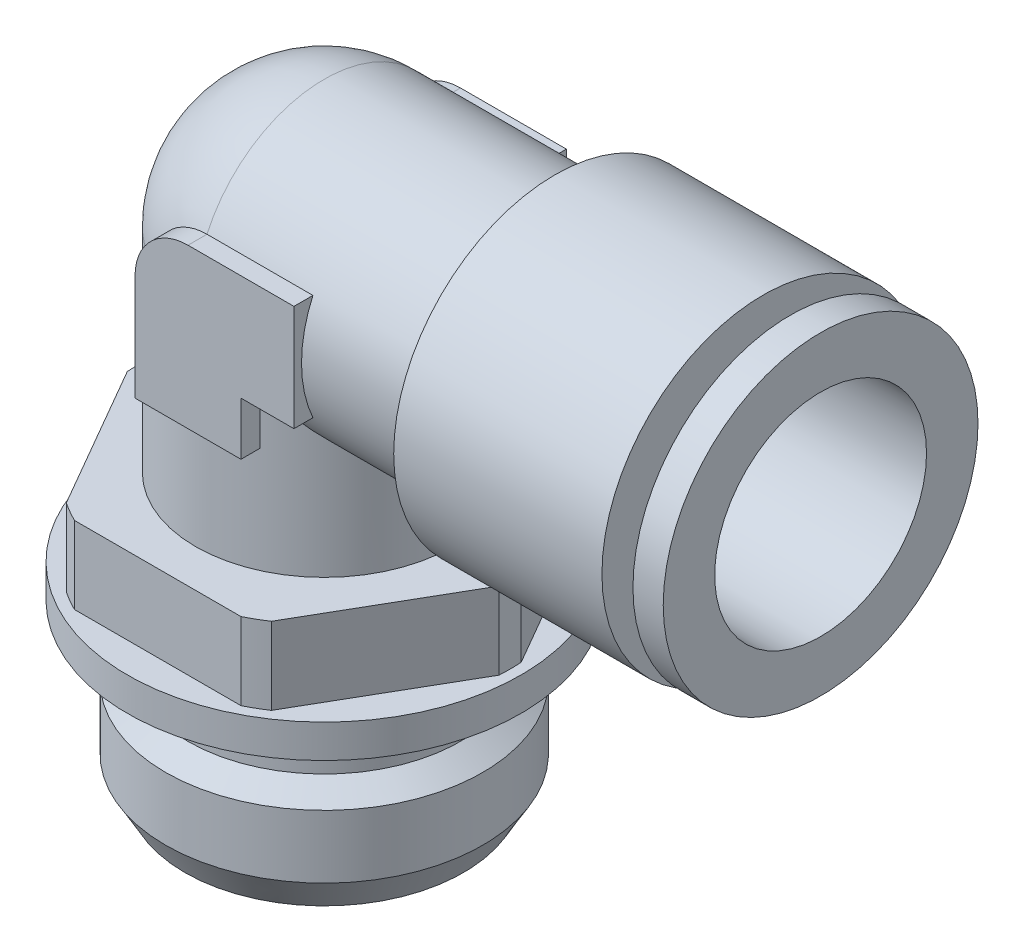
ISO-10303-21;
HEADER;
FILE_DESCRIPTION(('STEP AP214'),'2;1');
FILE_NAME('part.step','',(''),(''),'','','');
FILE_SCHEMA(('AUTOMOTIVE_DESIGN { 1 0 10303 214 1 1 1 1 }'));
ENDSEC;
DATA;
#1=APPLICATION_CONTEXT('core data for automotive mechanical design processes');
#2=APPLICATION_PROTOCOL_DEFINITION('international standard','automotive_design',2000,#1);
#3=PRODUCT_CONTEXT('',#1,'mechanical');
#4=PRODUCT('Part','Part','',(#3));
#5=PRODUCT_RELATED_PRODUCT_CATEGORY('part','',(#4));
#6=PRODUCT_DEFINITION_FORMATION('','',#4);
#7=PRODUCT_DEFINITION_CONTEXT('part definition',#1,'design');
#8=PRODUCT_DEFINITION('design','',#6,#7);
#9=PRODUCT_DEFINITION_SHAPE('','',#8);
#10=(LENGTH_UNIT() NAMED_UNIT(*) SI_UNIT(.MILLI.,.METRE.));
#11=(NAMED_UNIT(*) PLANE_ANGLE_UNIT() SI_UNIT($,.RADIAN.));
#12=(NAMED_UNIT(*) SI_UNIT($,.STERADIAN.) SOLID_ANGLE_UNIT());
#13=UNCERTAINTY_MEASURE_WITH_UNIT(LENGTH_MEASURE(1.E-05),#10,'distance_accuracy_value','');
#14=(GEOMETRIC_REPRESENTATION_CONTEXT(3) GLOBAL_UNCERTAINTY_ASSIGNED_CONTEXT((#13)) GLOBAL_UNIT_ASSIGNED_CONTEXT((#10,
#11,#12)) REPRESENTATION_CONTEXT('',''));
#15=CARTESIAN_POINT('',(0.,0.,0.));
#16=DIRECTION('',(0.,0.,1.));
#17=DIRECTION('',(1.,0.,0.));
#18=AXIS2_PLACEMENT_3D('',#15,#16,#17);
#19=CARTESIAN_POINT('',(0.,-30.1,0.));
#20=DIRECTION('',(0.,1.,0.));
#21=DIRECTION('',(0.,0.,1.));
#22=AXIS2_PLACEMENT_3D('',#19,#20,#21);
#23=CONICAL_SURFACE('',#22,10.4775,0.523598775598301);
#24=CARTESIAN_POINT('',(0.,-32.3,0.));
#25=DIRECTION('',(0.,1.,0.));
#26=DIRECTION('',(0.,0.,1.));
#27=AXIS2_PLACEMENT_3D('',#24,#25,#26);
#28=CIRCLE('',#27,9.20732940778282);
#29=CARTESIAN_POINT('',(0.,-32.3,9.20732940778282));
#30=VERTEX_POINT('',#29);
#31=EDGE_CURVE('E20',#30,#30,#28,.T.);
#32=ORIENTED_EDGE('',*,*,#31,.T.);
#33=EDGE_LOOP('',(#32));
#34=FACE_BOUND('',#33,.T.);
#35=CARTESIAN_POINT('',(0.,-30.1,0.));
#36=DIRECTION('',(0.,-1.,0.));
#37=DIRECTION('',(0.,0.,-1.));
#38=AXIS2_PLACEMENT_3D('',#35,#36,#37);
#39=CIRCLE('',#38,10.4775);
#40=CARTESIAN_POINT('',(0.,-30.1,-10.4775));
#41=VERTEX_POINT('',#40);
#42=EDGE_CURVE('E219',#41,#41,#39,.F.);
#43=ORIENTED_EDGE('',*,*,#42,.F.);
#44=EDGE_LOOP('',(#43));
#45=FACE_BOUND('',#44,.T.);
#46=ADVANCED_FACE('F16',(#34,#45),#23,.T.);
#47=CARTESIAN_POINT('',(0.,-19.6147348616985,0.));
#48=DIRECTION('',(0.,-1.,0.));
#49=DIRECTION('',(0.,0.,-1.));
#50=AXIS2_PLACEMENT_3D('',#47,#48,#49);
#51=CYLINDRICAL_SURFACE('',#50,10.4775);
#52=ORIENTED_EDGE('',*,*,#42,.T.);
#53=EDGE_LOOP('',(#52));
#54=FACE_BOUND('',#53,.T.);
#55=CARTESIAN_POINT('',(0.,-25.9345566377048,0.));
#56=DIRECTION('',(0.,-1.,0.));
#57=DIRECTION('',(0.,0.,-1.));
#58=AXIS2_PLACEMENT_3D('',#55,#56,#57);
#59=CIRCLE('',#58,10.4775);
#60=CARTESIAN_POINT('',(0.,-25.9345566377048,-10.4775));
#61=VERTEX_POINT('',#60);
#62=EDGE_CURVE('E215',#61,#61,#59,.F.);
#63=ORIENTED_EDGE('',*,*,#62,.F.);
#64=EDGE_LOOP('',(#63));
#65=FACE_BOUND('',#64,.T.);
#66=ADVANCED_FACE('F1185',(#54,#65),#51,.T.);
#67=CARTESIAN_POINT('',(-9.20732940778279,-32.3,0.));
#68=DIRECTION('',(0.,1.,0.));
#69=DIRECTION('',(0.,0.,1.));
#70=AXIS2_PLACEMENT_3D('',#67,#68,#69);
#71=PLANE('',#70);
#72=ORIENTED_EDGE('',*,*,#31,.F.);
#73=EDGE_LOOP('',(#72));
#74=FACE_BOUND('',#73,.T.);
#75=CARTESIAN_POINT('',(0.,-32.3,0.));
#76=DIRECTION('',(0.,-1.,0.));
#77=DIRECTION('',(0.,0.,-1.));
#78=AXIS2_PLACEMENT_3D('',#75,#76,#77);
#79=CIRCLE('',#78,5.85);
#80=CARTESIAN_POINT('',(0.,-32.3,-5.85));
#81=VERTEX_POINT('',#80);
#82=EDGE_CURVE('E214',#81,#81,#79,.F.);
#83=ORIENTED_EDGE('',*,*,#82,.T.);
#84=EDGE_LOOP('',(#83));
#85=FACE_BOUND('',#84,.T.);
#86=ADVANCED_FACE('F352',(#74,#85),#71,.F.);
#87=CARTESIAN_POINT('',(0.,-25.9345566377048,0.));
#88=DIRECTION('',(0.,-1.,0.));
#89=DIRECTION('',(0.,0.,-1.));
#90=AXIS2_PLACEMENT_3D('',#87,#88,#89);
#91=CONICAL_SURFACE('',#90,10.4775,0.959931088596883);
#92=ORIENTED_EDGE('',*,*,#62,.T.);
#93=EDGE_LOOP('',(#92));
#94=FACE_BOUND('',#93,.T.);
#95=CARTESIAN_POINT('',(0.,-24.9,0.));
#96=DIRECTION('',(0.,-1.,0.));
#97=DIRECTION('',(0.,0.,-1.));
#98=AXIS2_PLACEMENT_3D('',#95,#96,#97);
#99=CIRCLE('',#98,9.);
#100=CARTESIAN_POINT('',(0.,-24.9,-9.00000000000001));
#101=VERTEX_POINT('',#100);
#102=EDGE_CURVE('E210',#101,#101,#99,.F.);
#103=ORIENTED_EDGE('',*,*,#102,.F.);
#104=EDGE_LOOP('',(#103));
#105=FACE_BOUND('',#104,.T.);
#106=ADVANCED_FACE('F357',(#94,#105),#91,.T.);
#107=CARTESIAN_POINT('',(0.,2.54629867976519,0.));
#108=DIRECTION('',(0.,-1.,0.));
#109=DIRECTION('',(0.,0.,-1.));
#110=AXIS2_PLACEMENT_3D('',#107,#108,#109);
#111=CYLINDRICAL_SURFACE('',#110,5.85);
#112=CARTESIAN_POINT('',(0.,-14.,0.));
#113=DIRECTION('',(0.,-1.,0.));
#114=DIRECTION('',(0.,0.,-1.));
#115=AXIS2_PLACEMENT_3D('',#112,#113,#114);
#116=CIRCLE('',#115,5.85);
#117=CARTESIAN_POINT('',(0.,-14.,-5.85));
#118=VERTEX_POINT('',#117);
#119=EDGE_CURVE('E209',#118,#118,#116,.T.);
#120=ORIENTED_EDGE('',*,*,#119,.F.);
#121=EDGE_LOOP('',(#120));
#122=FACE_BOUND('',#121,.T.);
#123=ORIENTED_EDGE('',*,*,#82,.F.);
#124=EDGE_LOOP('',(#123));
#125=FACE_BOUND('',#124,.T.);
#126=ADVANCED_FACE('F354',(#122,#125),#111,.F.);
#127=CARTESIAN_POINT('',(0.,-19.6147348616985,0.));
#128=DIRECTION('',(0.,-1.,0.));
#129=DIRECTION('',(0.,0.,-1.));
#130=AXIS2_PLACEMENT_3D('',#127,#128,#129);
#131=CYLINDRICAL_SURFACE('',#130,9.);
#132=ORIENTED_EDGE('',*,*,#102,.T.);
#133=EDGE_LOOP('',(#132));
#134=FACE_BOUND('',#133,.T.);
#135=CARTESIAN_POINT('',(0.,-21.3,0.));
#136=DIRECTION('',(0.,-1.,0.));
#137=DIRECTION('',(0.,0.,-1.));
#138=AXIS2_PLACEMENT_3D('',#135,#136,#137);
#139=CIRCLE('',#138,9.);
#140=CARTESIAN_POINT('',(0.,-21.3,-9.00000000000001));
#141=VERTEX_POINT('',#140);
#142=EDGE_CURVE('E205',#141,#141,#139,.F.);
#143=ORIENTED_EDGE('',*,*,#142,.F.);
#144=EDGE_LOOP('',(#143));
#145=FACE_BOUND('',#144,.T.);
#146=ADVANCED_FACE('F356',(#134,#145),#131,.T.);
#147=CARTESIAN_POINT('',(-8.49999999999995,-14.,0.));
#148=DIRECTION('',(0.,-1.,0.));
#149=DIRECTION('',(0.,0.,-1.));
#150=AXIS2_PLACEMENT_3D('',#147,#148,#149);
#151=PLANE('',#150);
#152=ORIENTED_EDGE('',*,*,#119,.T.);
#153=EDGE_LOOP('',(#152));
#154=FACE_BOUND('',#153,.T.);
#155=CARTESIAN_POINT('',(0.,-14.,0.));
#156=DIRECTION('',(0.,1.,0.));
#157=DIRECTION('',(0.,0.,1.));
#158=AXIS2_PLACEMENT_3D('',#155,#156,#157);
#159=CIRCLE('',#158,3.);
#160=CARTESIAN_POINT('',(0.,-14.,3.));
#161=VERTEX_POINT('',#160);
#162=EDGE_CURVE('E183',#161,#161,#159,.T.);
#163=ORIENTED_EDGE('',*,*,#162,.T.);
#164=EDGE_LOOP('',(#163));
#165=FACE_BOUND('',#164,.T.);
#166=ADVANCED_FACE('F364',(#154,#165),#151,.T.);
#167=CARTESIAN_POINT('',(0.,-21.3,0.));
#168=DIRECTION('',(0.,-1.,0.));
#169=DIRECTION('',(0.,0.,-1.));
#170=AXIS2_PLACEMENT_3D('',#167,#168,#169);
#171=TOROIDAL_SURFACE('',#170,10.31,1.31);
#172=ORIENTED_EDGE('',*,*,#142,.T.);
#173=EDGE_LOOP('',(#172));
#174=FACE_BOUND('',#173,.T.);
#175=CARTESIAN_POINT('',(0.,-21.3,0.));
#176=DIRECTION('',(0.,-1.,0.));
#177=DIRECTION('',(0.,0.,-1.));
#178=AXIS2_PLACEMENT_3D('',#175,#176,#177);
#179=CIRCLE('',#178,11.62);
#180=CARTESIAN_POINT('',(0.,-21.3,-11.62));
#181=VERTEX_POINT('',#180);
#182=EDGE_CURVE('E182',#181,#181,#179,.T.);
#183=ORIENTED_EDGE('',*,*,#182,.T.);
#184=EDGE_LOOP('',(#183));
#185=FACE_BOUND('',#184,.T.);
#186=ADVANCED_FACE('F1148',(#174,#185),#171,.T.);
#187=CARTESIAN_POINT('',(0.,2.67934415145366,0.));
#188=DIRECTION('',(0.,1.,0.));
#189=DIRECTION('',(0.,0.,1.));
#190=AXIS2_PLACEMENT_3D('',#187,#188,#189);
#191=CYLINDRICAL_SURFACE('',#190,3.);
#192=ORIENTED_EDGE('',*,*,#162,.F.);
#193=EDGE_LOOP('',(#192));
#194=FACE_BOUND('',#193,.T.);
#195=CARTESIAN_POINT('',(0.,0.,0.));
#196=DIRECTION('',(0.,1.,0.));
#197=DIRECTION('',(-1.,0.,0.));
#198=AXIS2_PLACEMENT_3D('',#195,#196,#197);
#199=CIRCLE('',#198,3.);
#200=CARTESIAN_POINT('',(0.,0.,-3.00000000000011));
#201=VERTEX_POINT('',#200);
#202=CARTESIAN_POINT('',(0.,0.,3.00000000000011));
#203=VERTEX_POINT('',#202);
#204=EDGE_CURVE('E171',#201,#203,#199,.T.);
#205=ORIENTED_EDGE('',*,*,#204,.T.);
#206=CARTESIAN_POINT('',(0.,0.,0.));
#207=DIRECTION('',(0.707106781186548,0.707106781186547,0.));
#208=DIRECTION('',(-0.707106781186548,0.707106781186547,0.));
#209=AXIS2_PLACEMENT_3D('',#206,#207,#208);
#210=ELLIPSE('',#209,4.24264068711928,3.);
#211=EDGE_CURVE('E185',#203,#201,#210,.T.);
#212=ORIENTED_EDGE('',*,*,#211,.T.);
#213=EDGE_LOOP('',(#205,#212));
#214=FACE_BOUND('',#213,.T.);
#215=ADVANCED_FACE('F186',(#194,#214),#191,.F.);
#216=CARTESIAN_POINT('',(0.,0.,0.));
#217=DIRECTION('',(0.,1.,0.));
#218=DIRECTION('',(-1.,0.,0.));
#219=AXIS2_PLACEMENT_3D('',#216,#217,#218);
#220=SPHERICAL_SURFACE('',#219,3.);
#221=ORIENTED_EDGE('',*,*,#204,.F.);
#222=CARTESIAN_POINT('',(0.,0.,0.));
#223=DIRECTION('',(1.,0.,0.));
#224=DIRECTION('',(0.,0.,-1.));
#225=AXIS2_PLACEMENT_3D('',#222,#223,#224);
#226=CIRCLE('',#225,3.);
#227=CARTESIAN_POINT('',(0.,3.,0.));
#228=VERTEX_POINT('',#227);
#229=EDGE_CURVE('E176',#201,#228,#226,.T.);
#230=ORIENTED_EDGE('',*,*,#229,.T.);
#231=CARTESIAN_POINT('',(0.,0.,0.));
#232=DIRECTION('',(1.,0.,0.));
#233=DIRECTION('',(0.,0.,-1.));
#234=AXIS2_PLACEMENT_3D('',#231,#232,#233);
#235=CIRCLE('',#234,3.);
#236=EDGE_CURVE('E179',#228,#203,#235,.T.);
#237=ORIENTED_EDGE('',*,*,#236,.T.);
#238=EDGE_LOOP('',(#221,#230,#237));
#239=FACE_BOUND('',#238,.T.);
#240=ADVANCED_FACE('F178',(#239),#220,.F.);
#241=CARTESIAN_POINT('',(-12.9999999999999,-21.3,0.));
#242=DIRECTION('',(0.,1.,0.));
#243=DIRECTION('',(0.,0.,1.));
#244=AXIS2_PLACEMENT_3D('',#241,#242,#243);
#245=PLANE('',#244);
#246=CARTESIAN_POINT('',(0.,-21.3,0.));
#247=DIRECTION('',(0.,-1.,0.));
#248=DIRECTION('',(0.,0.,-1.));
#249=AXIS2_PLACEMENT_3D('',#246,#247,#248);
#250=CIRCLE('',#249,13.);
#251=CARTESIAN_POINT('',(0.,-21.3,-13.));
#252=VERTEX_POINT('',#251);
#253=EDGE_CURVE('E198',#252,#252,#250,.F.);
#254=ORIENTED_EDGE('',*,*,#253,.F.);
#255=EDGE_LOOP('',(#254));
#256=FACE_BOUND('',#255,.T.);
#257=ORIENTED_EDGE('',*,*,#182,.F.);
#258=EDGE_LOOP('',(#257));
#259=FACE_BOUND('',#258,.T.);
#260=ADVANCED_FACE('F825',(#256,#259),#245,.F.);
#261=CARTESIAN_POINT('',(9.10972222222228,0.,0.));
#262=DIRECTION('',(1.,0.,0.));
#263=DIRECTION('',(0.,0.,-1.));
#264=AXIS2_PLACEMENT_3D('',#261,#262,#263);
#265=CYLINDRICAL_SURFACE('',#264,3.);
#266=ORIENTED_EDGE('',*,*,#229,.F.);
#267=ORIENTED_EDGE('',*,*,#211,.F.);
#268=ORIENTED_EDGE('',*,*,#236,.F.);
#269=EDGE_LOOP('',(#266,#267,#268));
#270=FACE_BOUND('',#269,.T.);
#271=CARTESIAN_POINT('',(10.824573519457,0.,0.));
#272=DIRECTION('',(1.,0.,0.));
#273=DIRECTION('',(0.,0.,-1.));
#274=AXIS2_PLACEMENT_3D('',#271,#272,#273);
#275=CIRCLE('',#274,3.);
#276=CARTESIAN_POINT('',(10.824573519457,0.,-3.));
#277=VERTEX_POINT('',#276);
#278=EDGE_CURVE('E334',#277,#277,#275,.T.);
#279=ORIENTED_EDGE('',*,*,#278,.T.);
#280=EDGE_LOOP('',(#279));
#281=FACE_BOUND('',#280,.T.);
#282=ADVANCED_FACE('F190',(#270,#281),#265,.F.);
#283=CARTESIAN_POINT('',(0.,-19.6147348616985,0.));
#284=DIRECTION('',(0.,-1.,0.));
#285=DIRECTION('',(0.,0.,-1.));
#286=AXIS2_PLACEMENT_3D('',#283,#284,#285);
#287=CYLINDRICAL_SURFACE('',#286,13.);
#288=ORIENTED_EDGE('',*,*,#253,.T.);
#289=EDGE_LOOP('',(#288));
#290=FACE_BOUND('',#289,.T.);
#291=CARTESIAN_POINT('',(0.,-19.1,0.));
#292=DIRECTION('',(0.,-1.,0.));
#293=DIRECTION('',(0.,0.,-1.));
#294=AXIS2_PLACEMENT_3D('',#291,#292,#293);
#295=CIRCLE('',#294,13.);
#296=CARTESIAN_POINT('',(0.,-19.1,-13.));
#297=VERTEX_POINT('',#296);
#298=EDGE_CURVE('E301',#297,#297,#295,.T.);
#299=ORIENTED_EDGE('',*,*,#298,.T.);
#300=EDGE_LOOP('',(#299));
#301=FACE_BOUND('',#300,.T.);
#302=ADVANCED_FACE('F656',(#290,#301),#287,.T.);
#303=CARTESIAN_POINT('',(13.1339745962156,0.,0.));
#304=DIRECTION('',(1.,0.,0.));
#305=DIRECTION('',(0.,1.,0.));
#306=AXIS2_PLACEMENT_3D('',#303,#304,#305);
#307=CONICAL_SURFACE('',#306,7.,1.0471975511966);
#308=ORIENTED_EDGE('',*,*,#278,.F.);
#309=EDGE_LOOP('',(#308));
#310=FACE_BOUND('',#309,.T.);
#311=CARTESIAN_POINT('',(13.1339745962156,0.,0.));
#312=DIRECTION('',(1.,0.,0.));
#313=DIRECTION('',(0.,0.,-1.));
#314=AXIS2_PLACEMENT_3D('',#311,#312,#313);
#315=CIRCLE('',#314,7.);
#316=CARTESIAN_POINT('',(13.1339745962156,0.,-7.00000000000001));
#317=VERTEX_POINT('',#316);
#318=EDGE_CURVE('E296',#317,#317,#315,.T.);
#319=ORIENTED_EDGE('',*,*,#318,.T.);
#320=EDGE_LOOP('',(#319));
#321=FACE_BOUND('',#320,.T.);
#322=ADVANCED_FACE('F652',(#310,#321),#307,.F.);
#323=CARTESIAN_POINT('',(0.,-19.6147348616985,0.));
#324=DIRECTION('',(0.,-1.,0.));
#325=DIRECTION('',(0.,0.,-1.));
#326=AXIS2_PLACEMENT_3D('',#323,#324,#325);
#327=CYLINDRICAL_SURFACE('',#326,12.3);
#328=CARTESIAN_POINT('',(0.,-19.1,0.));
#329=DIRECTION('',(0.,-1.,0.));
#330=DIRECTION('',(0.,0.,-1.));
#331=AXIS2_PLACEMENT_3D('',#328,#329,#330);
#332=CIRCLE('',#331,12.3);
#333=CARTESIAN_POINT('',(6.77446186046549,-19.1,-10.2662878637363));
#334=VERTEX_POINT('',#333);
#335=CARTESIAN_POINT('',(5.50363516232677,-19.1,-11.0000000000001));
#336=VERTEX_POINT('',#335);
#337=EDGE_CURVE('E308',#334,#336,#332,.F.);
#338=ORIENTED_EDGE('',*,*,#337,.T.);
#339=DIRECTION('',(0.,1.,0.));
#340=VECTOR('',#339,1.);
#341=CARTESIAN_POINT('',(5.50363516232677,39.1920122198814,-11.0000000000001));
#342=LINE('',#341,#340);
#343=CARTESIAN_POINT('',(5.50363516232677,-14.,-11.0000000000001));
#344=VERTEX_POINT('',#343);
#345=EDGE_CURVE('E614',#336,#344,#342,.T.);
#346=ORIENTED_EDGE('',*,*,#345,.T.);
#347=CARTESIAN_POINT('',(0.,-14.,0.));
#348=DIRECTION('',(0.,-1.,0.));
#349=DIRECTION('',(0.,0.,-1.));
#350=AXIS2_PLACEMENT_3D('',#347,#348,#349);
#351=CIRCLE('',#350,12.3);
#352=CARTESIAN_POINT('',(6.77446186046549,-14.,-10.2662878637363));
#353=VERTEX_POINT('',#352);
#354=EDGE_CURVE('E331',#344,#353,#351,.T.);
#355=ORIENTED_EDGE('',*,*,#354,.T.);
#356=DIRECTION('',(0.,1.,0.));
#357=VECTOR('',#356,1.);
#358=CARTESIAN_POINT('',(6.77446186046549,39.1920122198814,-10.2662878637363));
#359=LINE('',#358,#357);
#360=EDGE_CURVE('E610',#353,#334,#359,.F.);
#361=ORIENTED_EDGE('',*,*,#360,.T.);
#362=EDGE_LOOP('',(#338,#346,#355,#361));
#363=FACE_BOUND('',#362,.T.);
#364=ADVANCED_FACE('F655',(#363),#327,.T.);
#365=CARTESIAN_POINT('',(0.,-19.6147348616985,0.));
#366=DIRECTION('',(0.,-1.,0.));
#367=DIRECTION('',(0.,0.,-1.));
#368=AXIS2_PLACEMENT_3D('',#365,#366,#367);
#369=CYLINDRICAL_SURFACE('',#368,12.3);
#370=CARTESIAN_POINT('',(0.,-19.1,0.));
#371=DIRECTION('',(0.,-1.,0.));
#372=DIRECTION('',(0.,0.,-1.));
#373=AXIS2_PLACEMENT_3D('',#370,#371,#372);
#374=CIRCLE('',#373,12.3);
#375=CARTESIAN_POINT('',(12.2780970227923,-19.1,0.733712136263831));
#376=VERTEX_POINT('',#375);
#377=CARTESIAN_POINT('',(12.2780970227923,-19.1,-0.733712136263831));
#378=VERTEX_POINT('',#377);
#379=EDGE_CURVE('E311',#376,#378,#374,.F.);
#380=ORIENTED_EDGE('',*,*,#379,.T.);
#381=DIRECTION('',(0.,1.,0.));
#382=VECTOR('',#381,1.);
#383=CARTESIAN_POINT('',(12.2780970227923,39.1920122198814,-0.733712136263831));
#384=LINE('',#383,#382);
#385=CARTESIAN_POINT('',(12.2780970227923,-14.,-0.733712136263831));
#386=VERTEX_POINT('',#385);
#387=EDGE_CURVE('E606',#378,#386,#384,.T.);
#388=ORIENTED_EDGE('',*,*,#387,.T.);
#389=CARTESIAN_POINT('',(0.,-14.,0.));
#390=DIRECTION('',(0.,-1.,0.));
#391=DIRECTION('',(0.,0.,-1.));
#392=AXIS2_PLACEMENT_3D('',#389,#390,#391);
#393=CIRCLE('',#392,12.3);
#394=CARTESIAN_POINT('',(12.2780970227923,-14.,0.733712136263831));
#395=VERTEX_POINT('',#394);
#396=EDGE_CURVE('E329',#386,#395,#393,.T.);
#397=ORIENTED_EDGE('',*,*,#396,.T.);
#398=DIRECTION('',(0.,1.,0.));
#399=VECTOR('',#398,1.);
#400=CARTESIAN_POINT('',(12.2780970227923,39.1920122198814,0.733712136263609));
#401=LINE('',#400,#399);
#402=EDGE_CURVE('E602',#395,#376,#401,.F.);
#403=ORIENTED_EDGE('',*,*,#402,.T.);
#404=EDGE_LOOP('',(#380,#388,#397,#403));
#405=FACE_BOUND('',#404,.T.);
#406=ADVANCED_FACE('F837',(#405),#369,.T.);
#407=CARTESIAN_POINT('',(0.,-19.6147348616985,0.));
#408=DIRECTION('',(0.,-1.,0.));
#409=DIRECTION('',(0.,0.,-1.));
#410=AXIS2_PLACEMENT_3D('',#407,#408,#409);
#411=CYLINDRICAL_SURFACE('',#410,12.3);
#412=CARTESIAN_POINT('',(0.,-19.1,0.));
#413=DIRECTION('',(0.,-1.,0.));
#414=DIRECTION('',(0.,0.,-1.));
#415=AXIS2_PLACEMENT_3D('',#412,#413,#414);
#416=CIRCLE('',#415,12.3);
#417=CARTESIAN_POINT('',(5.50363516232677,-19.1,11.0000000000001));
#418=VERTEX_POINT('',#417);
#419=CARTESIAN_POINT('',(6.77446186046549,-19.1,10.2662878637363));
#420=VERTEX_POINT('',#419);
#421=EDGE_CURVE('E314',#418,#420,#416,.F.);
#422=ORIENTED_EDGE('',*,*,#421,.T.);
#423=DIRECTION('',(0.,1.,0.));
#424=VECTOR('',#423,1.);
#425=CARTESIAN_POINT('',(6.77446186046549,39.1920122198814,10.2662878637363));
#426=LINE('',#425,#424);
#427=CARTESIAN_POINT('',(6.77446186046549,-14.,10.2662878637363));
#428=VERTEX_POINT('',#427);
#429=EDGE_CURVE('E598',#420,#428,#426,.T.);
#430=ORIENTED_EDGE('',*,*,#429,.T.);
#431=CARTESIAN_POINT('',(0.,-14.,0.));
#432=DIRECTION('',(0.,-1.,0.));
#433=DIRECTION('',(0.,0.,-1.));
#434=AXIS2_PLACEMENT_3D('',#431,#432,#433);
#435=CIRCLE('',#434,12.3);
#436=CARTESIAN_POINT('',(5.50363516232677,-14.,11.0000000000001));
#437=VERTEX_POINT('',#436);
#438=EDGE_CURVE('E326',#428,#437,#435,.T.);
#439=ORIENTED_EDGE('',*,*,#438,.T.);
#440=DIRECTION('',(0.,1.,0.));
#441=VECTOR('',#440,1.);
#442=CARTESIAN_POINT('',(5.50363516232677,39.1920122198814,11.0000000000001));
#443=LINE('',#442,#441);
#444=EDGE_CURVE('E594',#437,#418,#443,.F.);
#445=ORIENTED_EDGE('',*,*,#444,.T.);
#446=EDGE_LOOP('',(#422,#430,#439,#445));
#447=FACE_BOUND('',#446,.T.);
#448=ADVANCED_FACE('F841',(#447),#411,.T.);
#449=CARTESIAN_POINT('',(0.,-19.6147348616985,0.));
#450=DIRECTION('',(0.,-1.,0.));
#451=DIRECTION('',(0.,0.,-1.));
#452=AXIS2_PLACEMENT_3D('',#449,#450,#451);
#453=CYLINDRICAL_SURFACE('',#452,12.3);
#454=CARTESIAN_POINT('',(0.,-19.1,0.));
#455=DIRECTION('',(0.,-1.,0.));
#456=DIRECTION('',(0.,0.,-1.));
#457=AXIS2_PLACEMENT_3D('',#454,#455,#456);
#458=CIRCLE('',#457,12.3);
#459=CARTESIAN_POINT('',(-6.77446186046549,-19.1,10.2662878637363));
#460=VERTEX_POINT('',#459);
#461=CARTESIAN_POINT('',(-5.50363516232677,-19.1,11.0000000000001));
#462=VERTEX_POINT('',#461);
#463=EDGE_CURVE('E317',#460,#462,#458,.F.);
#464=ORIENTED_EDGE('',*,*,#463,.T.);
#465=DIRECTION('',(0.,1.,0.));
#466=VECTOR('',#465,1.);
#467=CARTESIAN_POINT('',(-5.50363516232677,39.1920122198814,11.0000000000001));
#468=LINE('',#467,#466);
#469=CARTESIAN_POINT('',(-5.50363516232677,-14.,11.0000000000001));
#470=VERTEX_POINT('',#469);
#471=EDGE_CURVE('E590',#462,#470,#468,.T.);
#472=ORIENTED_EDGE('',*,*,#471,.T.);
#473=CARTESIAN_POINT('',(0.,-14.,0.));
#474=DIRECTION('',(0.,-1.,0.));
#475=DIRECTION('',(0.,0.,-1.));
#476=AXIS2_PLACEMENT_3D('',#473,#474,#475);
#477=CIRCLE('',#476,12.3);
#478=CARTESIAN_POINT('',(-6.77446186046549,-14.,10.2662878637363));
#479=VERTEX_POINT('',#478);
#480=EDGE_CURVE('E323',#470,#479,#477,.T.);
#481=ORIENTED_EDGE('',*,*,#480,.T.);
#482=DIRECTION('',(0.,1.,0.));
#483=VECTOR('',#482,1.);
#484=CARTESIAN_POINT('',(-6.77446186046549,39.1920122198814,10.2662878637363));
#485=LINE('',#484,#483);
#486=EDGE_CURVE('E586',#479,#460,#485,.F.);
#487=ORIENTED_EDGE('',*,*,#486,.T.);
#488=EDGE_LOOP('',(#464,#472,#481,#487));
#489=FACE_BOUND('',#488,.T.);
#490=ADVANCED_FACE('F845',(#489),#453,.T.);
#491=CARTESIAN_POINT('',(0.,-19.6147348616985,0.));
#492=DIRECTION('',(0.,-1.,0.));
#493=DIRECTION('',(0.,0.,-1.));
#494=AXIS2_PLACEMENT_3D('',#491,#492,#493);
#495=CYLINDRICAL_SURFACE('',#494,12.3);
#496=CARTESIAN_POINT('',(0.,-19.1,0.));
#497=DIRECTION('',(0.,-1.,0.));
#498=DIRECTION('',(0.,0.,-1.));
#499=AXIS2_PLACEMENT_3D('',#496,#497,#498);
#500=CIRCLE('',#499,12.3);
#501=CARTESIAN_POINT('',(-12.2780970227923,-19.1,-0.733712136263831));
#502=VERTEX_POINT('',#501);
#503=CARTESIAN_POINT('',(-12.2780970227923,-19.1,0.733712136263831));
#504=VERTEX_POINT('',#503);
#505=EDGE_CURVE('E305',#502,#504,#500,.F.);
#506=ORIENTED_EDGE('',*,*,#505,.T.);
#507=DIRECTION('',(0.,1.,0.));
#508=VECTOR('',#507,1.);
#509=CARTESIAN_POINT('',(-12.2780970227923,39.1920122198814,0.733712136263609));
#510=LINE('',#509,#508);
#511=CARTESIAN_POINT('',(-12.2780970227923,-14.,0.733712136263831));
#512=VERTEX_POINT('',#511);
#513=EDGE_CURVE('E582',#504,#512,#510,.T.);
#514=ORIENTED_EDGE('',*,*,#513,.T.);
#515=CARTESIAN_POINT('',(0.,-14.,0.));
#516=DIRECTION('',(0.,-1.,0.));
#517=DIRECTION('',(0.,0.,-1.));
#518=AXIS2_PLACEMENT_3D('',#515,#516,#517);
#519=CIRCLE('',#518,12.3);
#520=CARTESIAN_POINT('',(-12.2780970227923,-14.,-0.733712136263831));
#521=VERTEX_POINT('',#520);
#522=EDGE_CURVE('E320',#512,#521,#519,.T.);
#523=ORIENTED_EDGE('',*,*,#522,.T.);
#524=DIRECTION('',(0.,1.,0.));
#525=VECTOR('',#524,1.);
#526=CARTESIAN_POINT('',(-12.2780970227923,39.1920122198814,-0.733712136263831));
#527=LINE('',#526,#525);
#528=EDGE_CURVE('E578',#521,#502,#527,.F.);
#529=ORIENTED_EDGE('',*,*,#528,.T.);
#530=EDGE_LOOP('',(#506,#514,#523,#529));
#531=FACE_BOUND('',#530,.T.);
#532=ADVANCED_FACE('F849',(#531),#495,.T.);
#533=CARTESIAN_POINT('',(-12.3,-19.1,0.));
#534=DIRECTION('',(0.,-1.,0.));
#535=DIRECTION('',(0.,0.,-1.));
#536=AXIS2_PLACEMENT_3D('',#533,#534,#535);
#537=PLANE('',#536);
#538=ORIENTED_EDGE('',*,*,#298,.F.);
#539=EDGE_LOOP('',(#538));
#540=FACE_BOUND('',#539,.T.);
#541=DIRECTION('',(0.5,0.,-0.86602540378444));
#542=VECTOR('',#541,1.);
#543=CARTESIAN_POINT('',(-6.35085296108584,-19.1,-11.0000000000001));
#544=LINE('',#543,#542);
#545=CARTESIAN_POINT('',(-6.77446186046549,-19.1,-10.2662878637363));
#546=VERTEX_POINT('',#545);
#547=EDGE_CURVE('E581',#502,#546,#544,.T.);
#548=ORIENTED_EDGE('',*,*,#547,.T.);
#549=CARTESIAN_POINT('',(0.,-19.1,0.));
#550=DIRECTION('',(0.,-1.,0.));
#551=DIRECTION('',(0.,0.,-1.));
#552=AXIS2_PLACEMENT_3D('',#549,#550,#551);
#553=CIRCLE('',#552,12.3);
#554=CARTESIAN_POINT('',(-5.50363516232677,-19.1,-11.0000000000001));
#555=VERTEX_POINT('',#554);
#556=EDGE_CURVE('E297',#555,#546,#553,.F.);
#557=ORIENTED_EDGE('',*,*,#556,.F.);
#558=DIRECTION('',(1.,0.,0.));
#559=VECTOR('',#558,1.);
#560=CARTESIAN_POINT('',(6.35085296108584,-19.1,-11.0000000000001));
#561=LINE('',#560,#559);
#562=EDGE_CURVE('E622',#555,#336,#561,.T.);
#563=ORIENTED_EDGE('',*,*,#562,.T.);
#564=ORIENTED_EDGE('',*,*,#337,.F.);
#565=DIRECTION('',(0.500000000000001,0.,0.866025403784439));
#566=VECTOR('',#565,1.);
#567=CARTESIAN_POINT('',(12.7017059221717,-19.1,0.));
#568=LINE('',#567,#566);
#569=EDGE_CURVE('E613',#334,#378,#568,.T.);
#570=ORIENTED_EDGE('',*,*,#569,.T.);
#571=ORIENTED_EDGE('',*,*,#379,.F.);
#572=DIRECTION('',(-0.5,0.,0.86602540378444));
#573=VECTOR('',#572,1.);
#574=CARTESIAN_POINT('',(6.35085296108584,-19.1,11.0000000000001));
#575=LINE('',#574,#573);
#576=EDGE_CURVE('E605',#376,#420,#575,.T.);
#577=ORIENTED_EDGE('',*,*,#576,.T.);
#578=ORIENTED_EDGE('',*,*,#421,.F.);
#579=DIRECTION('',(-1.,0.,0.));
#580=VECTOR('',#579,1.);
#581=CARTESIAN_POINT('',(-6.35085296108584,-19.1,11.0000000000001));
#582=LINE('',#581,#580);
#583=EDGE_CURVE('E597',#418,#462,#582,.T.);
#584=ORIENTED_EDGE('',*,*,#583,.T.);
#585=ORIENTED_EDGE('',*,*,#463,.F.);
#586=DIRECTION('',(-0.500000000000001,0.,-0.866025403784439));
#587=VECTOR('',#586,1.);
#588=CARTESIAN_POINT('',(-12.7017059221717,-19.1,0.));
#589=LINE('',#588,#587);
#590=EDGE_CURVE('E589',#460,#504,#589,.T.);
#591=ORIENTED_EDGE('',*,*,#590,.T.);
#592=ORIENTED_EDGE('',*,*,#505,.F.);
#593=EDGE_LOOP('',(#548,#557,#563,#564,#570,#571,#577,#578,#584,#585,#591,#592));
#594=FACE_BOUND('',#593,.T.);
#595=ADVANCED_FACE('F853',(#540,#594),#537,.F.);
#596=CARTESIAN_POINT('',(0.,-19.6147348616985,0.));
#597=DIRECTION('',(0.,-1.,0.));
#598=DIRECTION('',(0.,0.,-1.));
#599=AXIS2_PLACEMENT_3D('',#596,#597,#598);
#600=CYLINDRICAL_SURFACE('',#599,12.3);
#601=CARTESIAN_POINT('',(0.,-14.,0.));
#602=DIRECTION('',(0.,-1.,0.));
#603=DIRECTION('',(0.,0.,-1.));
#604=AXIS2_PLACEMENT_3D('',#601,#602,#603);
#605=CIRCLE('',#604,12.3);
#606=CARTESIAN_POINT('',(-6.77446186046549,-14.,-10.2662878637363));
#607=VERTEX_POINT('',#606);
#608=CARTESIAN_POINT('',(-5.50363516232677,-14.,-11.0000000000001));
#609=VERTEX_POINT('',#608);
#610=EDGE_CURVE('E293',#607,#609,#605,.T.);
#611=ORIENTED_EDGE('',*,*,#610,.T.);
#612=DIRECTION('',(0.,1.,0.));
#613=VECTOR('',#612,1.);
#614=CARTESIAN_POINT('',(-5.50363516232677,39.1920122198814,-11.0000000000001));
#615=LINE('',#614,#613);
#616=EDGE_CURVE('E618',#609,#555,#615,.F.);
#617=ORIENTED_EDGE('',*,*,#616,.T.);
#618=ORIENTED_EDGE('',*,*,#556,.T.);
#619=DIRECTION('',(0.,1.,0.));
#620=VECTOR('',#619,1.);
#621=CARTESIAN_POINT('',(-6.77446186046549,39.1920122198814,-10.2662878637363));
#622=LINE('',#621,#620);
#623=EDGE_CURVE('E292',#546,#607,#622,.T.);
#624=ORIENTED_EDGE('',*,*,#623,.T.);
#625=EDGE_LOOP('',(#611,#617,#618,#624));
#626=FACE_BOUND('',#625,.T.);
#627=ADVANCED_FACE('F664',(#626),#600,.T.);
#628=CARTESIAN_POINT('',(-13.001,0.,0.));
#629=DIRECTION('',(1.,0.,0.));
#630=DIRECTION('',(0.,0.,-1.));
#631=AXIS2_PLACEMENT_3D('',#628,#629,#630);
#632=CYLINDRICAL_SURFACE('',#631,7.);
#633=ORIENTED_EDGE('',*,*,#318,.F.);
#634=EDGE_LOOP('',(#633));
#635=FACE_BOUND('',#634,.T.);
#636=CARTESIAN_POINT('',(32.7999999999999,0.,0.));
#637=DIRECTION('',(1.,0.,0.));
#638=DIRECTION('',(0.,0.,-1.));
#639=AXIS2_PLACEMENT_3D('',#636,#637,#638);
#640=CIRCLE('',#639,7.);
#641=CARTESIAN_POINT('',(32.7999999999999,0.,-7.00000000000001));
#642=VERTEX_POINT('',#641);
#643=EDGE_CURVE('E287',#642,#642,#640,.T.);
#644=ORIENTED_EDGE('',*,*,#643,.T.);
#645=EDGE_LOOP('',(#644));
#646=FACE_BOUND('',#645,.T.);
#647=ADVANCED_FACE('F660',(#635,#646),#632,.F.);
#648=CARTESIAN_POINT('',(6.35085296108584,39.1920122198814,-11.0000000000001));
#649=DIRECTION('',(0.,0.,1.));
#650=DIRECTION('',(1.,0.,0.));
#651=AXIS2_PLACEMENT_3D('',#648,#649,#650);
#652=PLANE('',#651);
#653=ORIENTED_EDGE('',*,*,#345,.F.);
#654=ORIENTED_EDGE('',*,*,#562,.F.);
#655=ORIENTED_EDGE('',*,*,#616,.F.);
#656=DIRECTION('',(1.,0.,0.));
#657=VECTOR('',#656,1.);
#658=CARTESIAN_POINT('',(-8.49999999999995,-14.,-11.0000000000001));
#659=LINE('',#658,#657);
#660=EDGE_CURVE('E291',#609,#344,#659,.T.);
#661=ORIENTED_EDGE('',*,*,#660,.T.);
#662=EDGE_LOOP('',(#653,#654,#655,#661));
#663=FACE_BOUND('',#662,.T.);
#664=ADVANCED_FACE('F663',(#663),#652,.F.);
#665=CARTESIAN_POINT('',(12.7017059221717,39.1920122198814,0.));
#666=DIRECTION('',(-0.866025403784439,0.,0.500000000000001));
#667=DIRECTION('',(0.500000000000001,0.,0.866025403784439));
#668=AXIS2_PLACEMENT_3D('',#665,#666,#667);
#669=PLANE('',#668);
#670=ORIENTED_EDGE('',*,*,#387,.F.);
#671=ORIENTED_EDGE('',*,*,#569,.F.);
#672=ORIENTED_EDGE('',*,*,#360,.F.);
#673=DIRECTION('',(0.500000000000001,0.,0.866025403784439));
#674=VECTOR('',#673,1.);
#675=CARTESIAN_POINT('',(6.77446186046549,-14.,-10.2662878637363));
#676=LINE('',#675,#674);
#677=EDGE_CURVE('E799',#353,#386,#676,.T.);
#678=ORIENTED_EDGE('',*,*,#677,.T.);
#679=EDGE_LOOP('',(#670,#671,#672,#678));
#680=FACE_BOUND('',#679,.T.);
#681=ADVANCED_FACE('F863',(#680),#669,.F.);
#682=CARTESIAN_POINT('',(6.35085296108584,39.1920122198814,11.0000000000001));
#683=DIRECTION('',(-0.86602540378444,0.,-0.5));
#684=DIRECTION('',(-0.5,0.,0.86602540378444));
#685=AXIS2_PLACEMENT_3D('',#682,#683,#684);
#686=PLANE('',#685);
#687=ORIENTED_EDGE('',*,*,#429,.F.);
#688=ORIENTED_EDGE('',*,*,#576,.F.);
#689=ORIENTED_EDGE('',*,*,#402,.F.);
#690=DIRECTION('',(-0.500000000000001,0.,0.866025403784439));
#691=VECTOR('',#690,1.);
#692=CARTESIAN_POINT('',(12.2780970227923,-14.,0.733712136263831));
#693=LINE('',#692,#691);
#694=EDGE_CURVE('E803',#395,#428,#693,.T.);
#695=ORIENTED_EDGE('',*,*,#694,.T.);
#696=EDGE_LOOP('',(#687,#688,#689,#695));
#697=FACE_BOUND('',#696,.T.);
#698=ADVANCED_FACE('F867',(#697),#686,.F.);
#699=CARTESIAN_POINT('',(-6.35085296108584,39.1920122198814,11.0000000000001));
#700=DIRECTION('',(0.,0.,-1.));
#701=DIRECTION('',(-1.,0.,0.));
#702=AXIS2_PLACEMENT_3D('',#699,#700,#701);
#703=PLANE('',#702);
#704=ORIENTED_EDGE('',*,*,#471,.F.);
#705=ORIENTED_EDGE('',*,*,#583,.F.);
#706=ORIENTED_EDGE('',*,*,#444,.F.);
#707=DIRECTION('',(1.,0.,0.));
#708=VECTOR('',#707,1.);
#709=CARTESIAN_POINT('',(-8.49999999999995,-14.,11.0000000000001));
#710=LINE('',#709,#708);
#711=EDGE_CURVE('E807',#437,#470,#710,.F.);
#712=ORIENTED_EDGE('',*,*,#711,.T.);
#713=EDGE_LOOP('',(#704,#705,#706,#712));
#714=FACE_BOUND('',#713,.T.);
#715=ADVANCED_FACE('F871',(#714),#703,.F.);
#716=CARTESIAN_POINT('',(-12.7017059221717,39.1920122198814,0.));
#717=DIRECTION('',(0.866025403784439,0.,-0.500000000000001));
#718=DIRECTION('',(-0.500000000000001,0.,-0.866025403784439));
#719=AXIS2_PLACEMENT_3D('',#716,#717,#718);
#720=PLANE('',#719);
#721=ORIENTED_EDGE('',*,*,#513,.F.);
#722=ORIENTED_EDGE('',*,*,#590,.F.);
#723=ORIENTED_EDGE('',*,*,#486,.F.);
#724=DIRECTION('',(-0.500000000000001,0.,-0.866025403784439));
#725=VECTOR('',#724,1.);
#726=CARTESIAN_POINT('',(-6.77446186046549,-14.,10.2662878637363));
#727=LINE('',#726,#725);
#728=EDGE_CURVE('E811',#479,#512,#727,.T.);
#729=ORIENTED_EDGE('',*,*,#728,.T.);
#730=EDGE_LOOP('',(#721,#722,#723,#729));
#731=FACE_BOUND('',#730,.T.);
#732=ADVANCED_FACE('F680',(#731),#720,.F.);
#733=CARTESIAN_POINT('',(-6.35085296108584,39.1920122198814,-11.0000000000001));
#734=DIRECTION('',(0.86602540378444,0.,0.5));
#735=DIRECTION('',(0.5,0.,-0.86602540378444));
#736=AXIS2_PLACEMENT_3D('',#733,#734,#735);
#737=PLANE('',#736);
#738=ORIENTED_EDGE('',*,*,#623,.F.);
#739=ORIENTED_EDGE('',*,*,#547,.F.);
#740=ORIENTED_EDGE('',*,*,#528,.F.);
#741=DIRECTION('',(0.5,0.,-0.86602540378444));
#742=VECTOR('',#741,1.);
#743=CARTESIAN_POINT('',(-12.2780970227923,-14.,-0.733712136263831));
#744=LINE('',#743,#742);
#745=EDGE_CURVE('E795',#521,#607,#744,.T.);
#746=ORIENTED_EDGE('',*,*,#745,.T.);
#747=EDGE_LOOP('',(#738,#739,#740,#746));
#748=FACE_BOUND('',#747,.T.);
#749=ADVANCED_FACE('F671',(#748),#737,.F.);
#750=CARTESIAN_POINT('',(32.7999999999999,0.,-10.4));
#751=DIRECTION('',(-1.,0.,0.));
#752=DIRECTION('',(0.,0.,1.));
#753=AXIS2_PLACEMENT_3D('',#750,#751,#752);
#754=PLANE('',#753);
#755=CARTESIAN_POINT('',(32.7999999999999,0.,0.));
#756=DIRECTION('',(-1.,0.,0.));
#757=DIRECTION('',(0.,0.,1.));
#758=AXIS2_PLACEMENT_3D('',#755,#756,#757);
#759=CIRCLE('',#758,10.4);
#760=CARTESIAN_POINT('',(32.7999999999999,0.,10.4));
#761=VERTEX_POINT('',#760);
#762=EDGE_CURVE('E281',#761,#761,#759,.T.);
#763=ORIENTED_EDGE('',*,*,#762,.F.);
#764=EDGE_LOOP('',(#763));
#765=FACE_BOUND('',#764,.T.);
#766=ORIENTED_EDGE('',*,*,#643,.F.);
#767=EDGE_LOOP('',(#766));
#768=FACE_BOUND('',#767,.T.);
#769=ADVANCED_FACE('F668',(#765,#768),#754,.F.);
#770=CARTESIAN_POINT('',(-3.50000000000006,0.,9.00000000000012));
#771=DIRECTION('',(1.,0.,0.));
#772=DIRECTION('',(0.,1.,0.));
#773=AXIS2_PLACEMENT_3D('',#770,#771,#772);
#774=PLANE('',#773);
#775=DIRECTION('',(0.,0.,-1.));
#776=VECTOR('',#775,1.);
#777=CARTESIAN_POINT('',(-3.50000000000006,0.,9.00000000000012));
#778=LINE('',#777,#776);
#779=CARTESIAN_POINT('',(-3.50000000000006,0.,-9.00000000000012));
#780=VERTEX_POINT('',#779);
#781=CARTESIAN_POINT('',(-3.50000000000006,0.,-7.7459666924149));
#782=VERTEX_POINT('',#781);
#783=EDGE_CURVE('E280',#780,#782,#778,.F.);
#784=ORIENTED_EDGE('',*,*,#783,.F.);
#785=DIRECTION('',(0.,1.,0.));
#786=VECTOR('',#785,1.);
#787=CARTESIAN_POINT('',(-3.50000000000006,0.,-9.00000000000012));
#788=LINE('',#787,#786);
#789=CARTESIAN_POINT('',(-3.50000000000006,-7.00000000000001,-9.00000000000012));
#790=VERTEX_POINT('',#789);
#791=EDGE_CURVE('E547',#780,#790,#788,.F.);
#792=ORIENTED_EDGE('',*,*,#791,.T.);
#793=DIRECTION('',(0.,0.,1.));
#794=VECTOR('',#793,1.);
#795=CARTESIAN_POINT('',(-3.50000000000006,-7.00000000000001,9.00000000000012));
#796=LINE('',#795,#794);
#797=CARTESIAN_POINT('',(-3.50000000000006,-7.00000000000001,-7.7459666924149));
#798=VERTEX_POINT('',#797);
#799=EDGE_CURVE('E555',#790,#798,#796,.T.);
#800=ORIENTED_EDGE('',*,*,#799,.T.);
#801=DIRECTION('',(0.,1.,0.));
#802=VECTOR('',#801,1.);
#803=CARTESIAN_POINT('',(-3.50000000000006,5.25030795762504,-7.7459666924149));
#804=LINE('',#803,#802);
#805=EDGE_CURVE('E500',#782,#798,#804,.F.);
#806=ORIENTED_EDGE('',*,*,#805,.F.);
#807=EDGE_LOOP('',(#784,#792,#800,#806));
#808=FACE_BOUND('',#807,.T.);
#809=ADVANCED_FACE('F670',(#808),#774,.F.);
#810=CARTESIAN_POINT('',(-3.50000000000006,0.,9.00000000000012));
#811=DIRECTION('',(1.,0.,0.));
#812=DIRECTION('',(0.,1.,0.));
#813=AXIS2_PLACEMENT_3D('',#810,#811,#812);
#814=PLANE('',#813);
#815=DIRECTION('',(0.,0.,1.));
#816=VECTOR('',#815,1.);
#817=CARTESIAN_POINT('',(-3.50000000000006,-7.00000000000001,9.00000000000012));
#818=LINE('',#817,#816);
#819=CARTESIAN_POINT('',(-3.50000000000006,-7.00000000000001,7.7459666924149));
#820=VERTEX_POINT('',#819);
#821=CARTESIAN_POINT('',(-3.50000000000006,-7.00000000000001,9.00000000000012));
#822=VERTEX_POINT('',#821);
#823=EDGE_CURVE('E560',#820,#822,#818,.T.);
#824=ORIENTED_EDGE('',*,*,#823,.T.);
#825=DIRECTION('',(0.,1.,0.));
#826=VECTOR('',#825,1.);
#827=CARTESIAN_POINT('',(-3.50000000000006,0.,9.00000000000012));
#828=LINE('',#827,#826);
#829=CARTESIAN_POINT('',(-3.50000000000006,0.,9.00000000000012));
#830=VERTEX_POINT('',#829);
#831=EDGE_CURVE('E273',#830,#822,#828,.F.);
#832=ORIENTED_EDGE('',*,*,#831,.F.);
#833=DIRECTION('',(0.,0.,-1.));
#834=VECTOR('',#833,1.);
#835=CARTESIAN_POINT('',(-3.50000000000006,0.,9.00000000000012));
#836=LINE('',#835,#834);
#837=CARTESIAN_POINT('',(-3.50000000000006,0.,7.7459666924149));
#838=VERTEX_POINT('',#837);
#839=EDGE_CURVE('E499',#838,#830,#836,.F.);
#840=ORIENTED_EDGE('',*,*,#839,.F.);
#841=DIRECTION('',(0.,1.,0.));
#842=VECTOR('',#841,1.);
#843=CARTESIAN_POINT('',(-3.50000000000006,5.25030795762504,7.7459666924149));
#844=LINE('',#843,#842);
#845=EDGE_CURVE('E279',#820,#838,#844,.T.);
#846=ORIENTED_EDGE('',*,*,#845,.F.);
#847=EDGE_LOOP('',(#824,#832,#840,#846));
#848=FACE_BOUND('',#847,.T.);
#849=ADVANCED_FACE('F677',(#848),#814,.F.);
#850=CARTESIAN_POINT('',(-8.49999999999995,-14.,0.));
#851=DIRECTION('',(0.,-1.,0.));
#852=DIRECTION('',(0.,0.,-1.));
#853=AXIS2_PLACEMENT_3D('',#850,#851,#852);
#854=PLANE('',#853);
#855=CARTESIAN_POINT('',(0.,-14.,0.));
#856=DIRECTION('',(0.,1.,0.));
#857=DIRECTION('',(0.,0.,1.));
#858=AXIS2_PLACEMENT_3D('',#855,#856,#857);
#859=CIRCLE('',#858,8.5);
#860=CARTESIAN_POINT('',(0.,-14.,8.50000000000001));
#861=VERTEX_POINT('',#860);
#862=EDGE_CURVE('E264',#861,#861,#859,.T.);
#863=ORIENTED_EDGE('',*,*,#862,.F.);
#864=EDGE_LOOP('',(#863));
#865=FACE_BOUND('',#864,.T.);
#866=ORIENTED_EDGE('',*,*,#745,.F.);
#867=ORIENTED_EDGE('',*,*,#522,.F.);
#868=ORIENTED_EDGE('',*,*,#728,.F.);
#869=ORIENTED_EDGE('',*,*,#480,.F.);
#870=ORIENTED_EDGE('',*,*,#711,.F.);
#871=ORIENTED_EDGE('',*,*,#438,.F.);
#872=ORIENTED_EDGE('',*,*,#694,.F.);
#873=ORIENTED_EDGE('',*,*,#396,.F.);
#874=ORIENTED_EDGE('',*,*,#677,.F.);
#875=ORIENTED_EDGE('',*,*,#354,.F.);
#876=ORIENTED_EDGE('',*,*,#660,.F.);
#877=ORIENTED_EDGE('',*,*,#610,.F.);
#878=EDGE_LOOP('',(#866,#867,#868,#869,#870,#871,#872,#873,#874,#875,#876,#877));
#879=FACE_BOUND('',#878,.T.);
#880=ADVANCED_FACE('F688',(#865,#879),#854,.F.);
#881=CARTESIAN_POINT('',(-3.50000000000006,-7.00000000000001,9.00000000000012));
#882=DIRECTION('',(0.,1.,0.));
#883=DIRECTION('',(-1.,0.,0.));
#884=AXIS2_PLACEMENT_3D('',#881,#882,#883);
#885=PLANE('',#884);
#886=ORIENTED_EDGE('',*,*,#799,.F.);
#887=DIRECTION('',(1.,0.,0.));
#888=VECTOR('',#887,1.);
#889=CARTESIAN_POINT('',(0.,-7.00000000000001,-9.00000000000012));
#890=LINE('',#889,#888);
#891=CARTESIAN_POINT('',(3.50000000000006,-6.99999999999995,-9.00000000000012));
#892=VERTEX_POINT('',#891);
#893=EDGE_CURVE('E525',#790,#892,#890,.T.);
#894=ORIENTED_EDGE('',*,*,#893,.T.);
#895=DIRECTION('',(0.,0.,1.));
#896=VECTOR('',#895,1.);
#897=CARTESIAN_POINT('',(3.50000000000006,-7.00000000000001,9.00000000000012));
#898=LINE('',#897,#896);
#899=CARTESIAN_POINT('',(3.50000000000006,-6.99999999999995,-7.7459666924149));
#900=VERTEX_POINT('',#899);
#901=EDGE_CURVE('E554',#892,#900,#898,.T.);
#902=ORIENTED_EDGE('',*,*,#901,.T.);
#903=CARTESIAN_POINT('',(0.,-7.00000000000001,0.));
#904=DIRECTION('',(0.,1.,0.));
#905=DIRECTION('',(0.,0.,1.));
#906=AXIS2_PLACEMENT_3D('',#903,#904,#905);
#907=CIRCLE('',#906,8.5);
#908=EDGE_CURVE('E259',#798,#900,#907,.F.);
#909=ORIENTED_EDGE('',*,*,#908,.F.);
#910=EDGE_LOOP('',(#886,#894,#902,#909));
#911=FACE_BOUND('',#910,.T.);
#912=ADVANCED_FACE('F692',(#911),#885,.F.);
#913=CARTESIAN_POINT('',(3.50000000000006,-3.49999999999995,9.00000000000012));
#914=DIRECTION('',(-1.,0.,0.));
#915=DIRECTION('',(0.,-1.,0.));
#916=AXIS2_PLACEMENT_3D('',#913,#914,#915);
#917=PLANE('',#916);
#918=ORIENTED_EDGE('',*,*,#901,.F.);
#919=DIRECTION('',(0.,1.,0.));
#920=VECTOR('',#919,1.);
#921=CARTESIAN_POINT('',(3.50000000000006,0.,-9.00000000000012));
#922=LINE('',#921,#920);
#923=CARTESIAN_POINT('',(3.50000000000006,-3.49999999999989,-9.00000000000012));
#924=VERTEX_POINT('',#923);
#925=EDGE_CURVE('E285',#892,#924,#922,.T.);
#926=ORIENTED_EDGE('',*,*,#925,.T.);
#927=DIRECTION('',(0.,0.,1.));
#928=VECTOR('',#927,1.);
#929=CARTESIAN_POINT('',(3.50000000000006,-3.49999999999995,9.00000000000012));
#930=LINE('',#929,#928);
#931=CARTESIAN_POINT('',(3.50000000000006,-3.49999999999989,-7.7459666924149));
#932=VERTEX_POINT('',#931);
#933=EDGE_CURVE('E550',#932,#924,#930,.F.);
#934=ORIENTED_EDGE('',*,*,#933,.F.);
#935=DIRECTION('',(0.,1.,0.));
#936=VECTOR('',#935,1.);
#937=CARTESIAN_POINT('',(3.50000000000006,5.2503079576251,-7.7459666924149));
#938=LINE('',#937,#936);
#939=EDGE_CURVE('E263',#900,#932,#938,.T.);
#940=ORIENTED_EDGE('',*,*,#939,.F.);
#941=EDGE_LOOP('',(#918,#926,#934,#940));
#942=FACE_BOUND('',#941,.T.);
#943=ADVANCED_FACE('F696',(#942),#917,.F.);
#944=CARTESIAN_POINT('',(3.50000000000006,-3.49999999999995,9.00000000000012));
#945=DIRECTION('',(-1.,0.,0.));
#946=DIRECTION('',(0.,-1.,0.));
#947=AXIS2_PLACEMENT_3D('',#944,#945,#946);
#948=PLANE('',#947);
#949=DIRECTION('',(0.,0.,1.));
#950=VECTOR('',#949,1.);
#951=CARTESIAN_POINT('',(3.50000000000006,-3.49999999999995,9.00000000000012));
#952=LINE('',#951,#950);
#953=CARTESIAN_POINT('',(3.50000000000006,-3.49999999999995,7.7459666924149));
#954=VERTEX_POINT('',#953);
#955=CARTESIAN_POINT('',(3.50000000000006,-3.49999999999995,9.00000000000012));
#956=VERTEX_POINT('',#955);
#957=EDGE_CURVE('E268',#954,#956,#952,.T.);
#958=ORIENTED_EDGE('',*,*,#957,.T.);
#959=DIRECTION('',(0.,1.,0.));
#960=VECTOR('',#959,1.);
#961=CARTESIAN_POINT('',(3.50000000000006,0.,9.00000000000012));
#962=LINE('',#961,#960);
#963=CARTESIAN_POINT('',(3.50000000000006,-7.00000000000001,9.00000000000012));
#964=VERTEX_POINT('',#963);
#965=EDGE_CURVE('E274',#964,#956,#962,.T.);
#966=ORIENTED_EDGE('',*,*,#965,.F.);
#967=DIRECTION('',(0.,0.,1.));
#968=VECTOR('',#967,1.);
#969=CARTESIAN_POINT('',(3.50000000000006,-7.00000000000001,9.00000000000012));
#970=LINE('',#969,#968);
#971=CARTESIAN_POINT('',(3.50000000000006,-7.00000000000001,7.7459666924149));
#972=VERTEX_POINT('',#971);
#973=EDGE_CURVE('E286',#964,#972,#970,.F.);
#974=ORIENTED_EDGE('',*,*,#973,.T.);
#975=DIRECTION('',(0.,1.,0.));
#976=VECTOR('',#975,1.);
#977=CARTESIAN_POINT('',(3.50000000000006,5.25030795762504,7.7459666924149));
#978=LINE('',#977,#976);
#979=EDGE_CURVE('E258',#954,#972,#978,.F.);
#980=ORIENTED_EDGE('',*,*,#979,.F.);
#981=EDGE_LOOP('',(#958,#966,#974,#980));
#982=FACE_BOUND('',#981,.T.);
#983=ADVANCED_FACE('F700',(#982),#948,.F.);
#984=CARTESIAN_POINT('',(-3.50000000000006,-7.00000000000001,9.00000000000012));
#985=DIRECTION('',(0.,1.,0.));
#986=DIRECTION('',(-1.,0.,0.));
#987=AXIS2_PLACEMENT_3D('',#984,#985,#986);
#988=PLANE('',#987);
#989=ORIENTED_EDGE('',*,*,#973,.F.);
#990=DIRECTION('',(1.,0.,0.));
#991=VECTOR('',#990,1.);
#992=CARTESIAN_POINT('',(0.,-7.00000000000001,9.00000000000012));
#993=LINE('',#992,#991);
#994=EDGE_CURVE('E505',#822,#964,#993,.T.);
#995=ORIENTED_EDGE('',*,*,#994,.F.);
#996=ORIENTED_EDGE('',*,*,#823,.F.);
#997=CARTESIAN_POINT('',(0.,-7.00000000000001,0.));
#998=DIRECTION('',(0.,1.,0.));
#999=DIRECTION('',(0.,0.,1.));
#1000=AXIS2_PLACEMENT_3D('',#997,#998,#999);
#1001=CIRCLE('',#1000,8.5);
#1002=EDGE_CURVE('E255',#972,#820,#1001,.F.);
#1003=ORIENTED_EDGE('',*,*,#1002,.F.);
#1004=EDGE_LOOP('',(#989,#995,#996,#1003));
#1005=FACE_BOUND('',#1004,.T.);
#1006=ADVANCED_FACE('F704',(#1005),#988,.F.);
#1007=CARTESIAN_POINT('',(-6.45273179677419,0.,0.));
#1008=DIRECTION('',(-1.,0.,0.));
#1009=DIRECTION('',(0.,0.,1.));
#1010=AXIS2_PLACEMENT_3D('',#1007,#1008,#1009);
#1011=CYLINDRICAL_SURFACE('',#1010,10.4);
#1012=CARTESIAN_POINT('',(30.7999999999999,0.,0.));
#1013=DIRECTION('',(-1.,0.,0.));
#1014=DIRECTION('',(0.,0.,1.));
#1015=AXIS2_PLACEMENT_3D('',#1012,#1013,#1014);
#1016=CIRCLE('',#1015,10.4);
#1017=CARTESIAN_POINT('',(30.7999999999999,0.,10.4));
#1018=VERTEX_POINT('',#1017);
#1019=EDGE_CURVE('E249',#1018,#1018,#1016,.F.);
#1020=ORIENTED_EDGE('',*,*,#1019,.T.);
#1021=EDGE_LOOP('',(#1020));
#1022=FACE_BOUND('',#1021,.T.);
#1023=ORIENTED_EDGE('',*,*,#762,.T.);
#1024=EDGE_LOOP('',(#1023));
#1025=FACE_BOUND('',#1024,.T.);
#1026=ADVANCED_FACE('F708',(#1022,#1025),#1011,.T.);
#1027=CARTESIAN_POINT('',(0.,0.,-9.00000000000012));
#1028=DIRECTION('',(0.,0.,1.));
#1029=DIRECTION('',(1.,0.,0.));
#1030=AXIS2_PLACEMENT_3D('',#1027,#1028,#1029);
#1031=PLANE('',#1030);
#1032=ORIENTED_EDGE('',*,*,#791,.F.);
#1033=CARTESIAN_POINT('',(0.,0.,-9.00000000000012));
#1034=DIRECTION('',(0.,0.,-1.));
#1035=DIRECTION('',(-1.,0.,0.));
#1036=AXIS2_PLACEMENT_3D('',#1033,#1034,#1035);
#1037=CIRCLE('',#1036,3.5);
#1038=CARTESIAN_POINT('',(0.,3.49999999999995,-9.00000000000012));
#1039=VERTEX_POINT('',#1038);
#1040=EDGE_CURVE('E275',#1039,#780,#1037,.F.);
#1041=ORIENTED_EDGE('',*,*,#1040,.F.);
#1042=DIRECTION('',(1.,0.,0.));
#1043=VECTOR('',#1042,1.);
#1044=CARTESIAN_POINT('',(0.,3.49999999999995,-9.00000000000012));
#1045=LINE('',#1044,#1043);
#1046=CARTESIAN_POINT('',(6.9999999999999,3.50000000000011,-9.00000000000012));
#1047=VERTEX_POINT('',#1046);
#1048=EDGE_CURVE('E469',#1039,#1047,#1045,.T.);
#1049=ORIENTED_EDGE('',*,*,#1048,.T.);
#1050=DIRECTION('',(0.,-1.,0.));
#1051=VECTOR('',#1050,1.);
#1052=CARTESIAN_POINT('',(6.9999999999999,3.50000000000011,-9.00000000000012));
#1053=LINE('',#1052,#1051);
#1054=CARTESIAN_POINT('',(7.00000000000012,-3.49999999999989,-9.00000000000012));
#1055=VERTEX_POINT('',#1054);
#1056=EDGE_CURVE('E253',#1047,#1055,#1053,.T.);
#1057=ORIENTED_EDGE('',*,*,#1056,.T.);
#1058=DIRECTION('',(-1.,0.,0.));
#1059=VECTOR('',#1058,1.);
#1060=CARTESIAN_POINT('',(3.50000000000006,-3.49999999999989,-9.00000000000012));
#1061=LINE('',#1060,#1059);
#1062=EDGE_CURVE('E254',#1055,#924,#1061,.T.);
#1063=ORIENTED_EDGE('',*,*,#1062,.T.);
#1064=ORIENTED_EDGE('',*,*,#925,.F.);
#1065=ORIENTED_EDGE('',*,*,#893,.F.);
#1066=EDGE_LOOP('',(#1032,#1041,#1049,#1057,#1063,#1064,#1065));
#1067=FACE_BOUND('',#1066,.T.);
#1068=ADVANCED_FACE('F712',(#1067),#1031,.F.);
#1069=CARTESIAN_POINT('',(0.,0.,9.00000000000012));
#1070=DIRECTION('',(0.,0.,-1.));
#1071=DIRECTION('',(-1.,0.,0.));
#1072=AXIS2_PLACEMENT_3D('',#1069,#1070,#1071);
#1073=CYLINDRICAL_SURFACE('',#1072,3.5);
#1074=DIRECTION('',(0.,0.,1.));
#1075=VECTOR('',#1074,1.);
#1076=CARTESIAN_POINT('',(0.,3.49999999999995,9.00000000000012));
#1077=LINE('',#1076,#1075);
#1078=CARTESIAN_POINT('',(0.,3.50000000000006,-7.7459666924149));
#1079=VERTEX_POINT('',#1078);
#1080=EDGE_CURVE('E454',#1079,#1039,#1077,.F.);
#1081=ORIENTED_EDGE('',*,*,#1080,.T.);
#1082=ORIENTED_EDGE('',*,*,#1040,.T.);
#1083=ORIENTED_EDGE('',*,*,#783,.T.);
#1084=CARTESIAN_POINT('',(0.,0.,-7.7459666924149));
#1085=DIRECTION('',(0.,0.,-1.));
#1086=DIRECTION('',(1.,0.,0.));
#1087=AXIS2_PLACEMENT_3D('',#1084,#1085,#1086);
#1088=CIRCLE('',#1087,3.5);
#1089=EDGE_CURVE('E450',#1079,#782,#1088,.F.);
#1090=ORIENTED_EDGE('',*,*,#1089,.F.);
#1091=EDGE_LOOP('',(#1081,#1082,#1083,#1090));
#1092=FACE_BOUND('',#1091,.T.);
#1093=ADVANCED_FACE('F716',(#1092),#1073,.T.);
#1094=CARTESIAN_POINT('',(0.,0.,9.00000000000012));
#1095=DIRECTION('',(0.,0.,-1.));
#1096=DIRECTION('',(-1.,0.,0.));
#1097=AXIS2_PLACEMENT_3D('',#1094,#1095,#1096);
#1098=CYLINDRICAL_SURFACE('',#1097,3.5);
#1099=ORIENTED_EDGE('',*,*,#839,.T.);
#1100=CARTESIAN_POINT('',(0.,0.,9.00000000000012));
#1101=DIRECTION('',(0.,0.,-1.));
#1102=DIRECTION('',(-1.,0.,0.));
#1103=AXIS2_PLACEMENT_3D('',#1100,#1101,#1102);
#1104=CIRCLE('',#1103,3.5);
#1105=CARTESIAN_POINT('',(0.,3.49999999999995,9.00000000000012));
#1106=VERTEX_POINT('',#1105);
#1107=EDGE_CURVE('E269',#1106,#830,#1104,.F.);
#1108=ORIENTED_EDGE('',*,*,#1107,.F.);
#1109=DIRECTION('',(0.,0.,-1.));
#1110=VECTOR('',#1109,1.);
#1111=CARTESIAN_POINT('',(0.,3.49999999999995,9.00000000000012));
#1112=LINE('',#1111,#1110);
#1113=CARTESIAN_POINT('',(0.,3.49999999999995,7.7459666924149));
#1114=VERTEX_POINT('',#1113);
#1115=EDGE_CURVE('E496',#1106,#1114,#1112,.T.);
#1116=ORIENTED_EDGE('',*,*,#1115,.T.);
#1117=CARTESIAN_POINT('',(0.,0.,7.7459666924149));
#1118=DIRECTION('',(0.,0.,-1.));
#1119=DIRECTION('',(1.,0.,0.));
#1120=AXIS2_PLACEMENT_3D('',#1117,#1118,#1119);
#1121=CIRCLE('',#1120,3.5);
#1122=EDGE_CURVE('E442',#838,#1114,#1121,.T.);
#1123=ORIENTED_EDGE('',*,*,#1122,.F.);
#1124=EDGE_LOOP('',(#1099,#1108,#1116,#1123));
#1125=FACE_BOUND('',#1124,.T.);
#1126=ADVANCED_FACE('F720',(#1125),#1098,.T.);
#1127=CARTESIAN_POINT('',(0.,0.,9.00000000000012));
#1128=DIRECTION('',(0.,0.,1.));
#1129=DIRECTION('',(1.,0.,0.));
#1130=AXIS2_PLACEMENT_3D('',#1127,#1128,#1129);
#1131=PLANE('',#1130);
#1132=ORIENTED_EDGE('',*,*,#1107,.T.);
#1133=ORIENTED_EDGE('',*,*,#831,.T.);
#1134=ORIENTED_EDGE('',*,*,#994,.T.);
#1135=ORIENTED_EDGE('',*,*,#965,.T.);
#1136=DIRECTION('',(-1.,0.,0.));
#1137=VECTOR('',#1136,1.);
#1138=CARTESIAN_POINT('',(3.50000000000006,-3.49999999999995,9.00000000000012));
#1139=LINE('',#1138,#1137);
#1140=CARTESIAN_POINT('',(7.00000000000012,-3.49999999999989,9.00000000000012));
#1141=VERTEX_POINT('',#1140);
#1142=EDGE_CURVE('E478',#956,#1141,#1139,.F.);
#1143=ORIENTED_EDGE('',*,*,#1142,.T.);
#1144=DIRECTION('',(0.,-1.,0.));
#1145=VECTOR('',#1144,1.);
#1146=CARTESIAN_POINT('',(6.9999999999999,3.50000000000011,9.00000000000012));
#1147=LINE('',#1146,#1145);
#1148=CARTESIAN_POINT('',(6.9999999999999,3.50000000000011,9.00000000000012));
#1149=VERTEX_POINT('',#1148);
#1150=EDGE_CURVE('E422',#1141,#1149,#1147,.F.);
#1151=ORIENTED_EDGE('',*,*,#1150,.T.);
#1152=DIRECTION('',(1.,0.,0.));
#1153=VECTOR('',#1152,1.);
#1154=CARTESIAN_POINT('',(0.,3.49999999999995,9.00000000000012));
#1155=LINE('',#1154,#1153);
#1156=EDGE_CURVE('E446',#1149,#1106,#1155,.F.);
#1157=ORIENTED_EDGE('',*,*,#1156,.T.);
#1158=EDGE_LOOP('',(#1132,#1133,#1134,#1135,#1143,#1151,#1157));
#1159=FACE_BOUND('',#1158,.T.);
#1160=ADVANCED_FACE('F724',(#1159),#1131,.T.);
#1161=CARTESIAN_POINT('',(3.50000000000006,-3.49999999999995,9.00000000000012));
#1162=DIRECTION('',(0.,1.,0.));
#1163=DIRECTION('',(-1.,0.,0.));
#1164=AXIS2_PLACEMENT_3D('',#1161,#1162,#1163);
#1165=PLANE('',#1164);
#1166=DIRECTION('',(-1.,0.,0.));
#1167=VECTOR('',#1166,1.);
#1168=CARTESIAN_POINT('',(-6.45273179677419,-3.49999999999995,7.7459666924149));
#1169=LINE('',#1168,#1167);
#1170=CARTESIAN_POINT('',(7.00000000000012,-3.49999999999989,7.7459666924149));
#1171=VERTEX_POINT('',#1170);
#1172=EDGE_CURVE('E248',#1171,#954,#1169,.T.);
#1173=ORIENTED_EDGE('',*,*,#1172,.F.);
#1174=DIRECTION('',(0.,0.,1.));
#1175=VECTOR('',#1174,1.);
#1176=CARTESIAN_POINT('',(7.00000000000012,-3.49999999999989,9.00000000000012));
#1177=LINE('',#1176,#1175);
#1178=EDGE_CURVE('E414',#1171,#1141,#1177,.T.);
#1179=ORIENTED_EDGE('',*,*,#1178,.T.);
#1180=ORIENTED_EDGE('',*,*,#1142,.F.);
#1181=ORIENTED_EDGE('',*,*,#957,.F.);
#1182=EDGE_LOOP('',(#1173,#1179,#1180,#1181));
#1183=FACE_BOUND('',#1182,.T.);
#1184=ADVANCED_FACE('F728',(#1183),#1165,.F.);
#1185=CARTESIAN_POINT('',(0.,5.25030795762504,0.));
#1186=DIRECTION('',(0.,1.,0.));
#1187=DIRECTION('',(0.,0.,1.));
#1188=AXIS2_PLACEMENT_3D('',#1185,#1186,#1187);
#1189=CYLINDRICAL_SURFACE('',#1188,8.5);
#1190=ORIENTED_EDGE('',*,*,#805,.T.);
#1191=ORIENTED_EDGE('',*,*,#908,.T.);
#1192=ORIENTED_EDGE('',*,*,#939,.T.);
#1193=CARTESIAN_POINT('',(0.,0.,0.));
#1194=DIRECTION('',(0.707106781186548,0.707106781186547,0.));
#1195=DIRECTION('',(-0.707106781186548,0.707106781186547,0.));
#1196=AXIS2_PLACEMENT_3D('',#1193,#1194,#1195);
#1197=ELLIPSE('',#1196,12.0208152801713,8.5);
#1198=EDGE_CURVE('E244',#954,#932,#1197,.T.);
#1199=ORIENTED_EDGE('',*,*,#1198,.F.);
#1200=ORIENTED_EDGE('',*,*,#979,.T.);
#1201=ORIENTED_EDGE('',*,*,#1002,.T.);
#1202=ORIENTED_EDGE('',*,*,#845,.T.);
#1203=CARTESIAN_POINT('',(0.,0.,0.));
#1204=DIRECTION('',(0.,1.,0.));
#1205=DIRECTION('',(0.,0.,-1.));
#1206=AXIS2_PLACEMENT_3D('',#1203,#1204,#1205);
#1207=CIRCLE('',#1206,8.5);
#1208=EDGE_CURVE('E447',#782,#838,#1207,.T.);
#1209=ORIENTED_EDGE('',*,*,#1208,.F.);
#1210=EDGE_LOOP('',(#1190,#1191,#1192,#1199,#1200,#1201,#1202,#1209));
#1211=FACE_BOUND('',#1210,.T.);
#1212=ORIENTED_EDGE('',*,*,#862,.T.);
#1213=EDGE_LOOP('',(#1212));
#1214=FACE_BOUND('',#1213,.T.);
#1215=ADVANCED_FACE('F732',(#1211,#1214),#1189,.T.);
#1216=CARTESIAN_POINT('',(3.50000000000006,-3.49999999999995,9.00000000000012));
#1217=DIRECTION('',(0.,1.,0.));
#1218=DIRECTION('',(-1.,0.,0.));
#1219=AXIS2_PLACEMENT_3D('',#1216,#1217,#1218);
#1220=PLANE('',#1219);
#1221=DIRECTION('',(-1.,0.,0.));
#1222=VECTOR('',#1221,1.);
#1223=CARTESIAN_POINT('',(-6.45273179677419,-3.49999999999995,-7.7459666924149));
#1224=LINE('',#1223,#1222);
#1225=CARTESIAN_POINT('',(7.00000000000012,-3.49999999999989,-7.7459666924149));
#1226=VERTEX_POINT('',#1225);
#1227=EDGE_CURVE('E243',#932,#1226,#1224,.F.);
#1228=ORIENTED_EDGE('',*,*,#1227,.F.);
#1229=ORIENTED_EDGE('',*,*,#933,.T.);
#1230=ORIENTED_EDGE('',*,*,#1062,.F.);
#1231=DIRECTION('',(0.,0.,1.));
#1232=VECTOR('',#1231,1.);
#1233=CARTESIAN_POINT('',(7.00000000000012,-3.49999999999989,9.00000000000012));
#1234=LINE('',#1233,#1232);
#1235=EDGE_CURVE('E531',#1055,#1226,#1234,.T.);
#1236=ORIENTED_EDGE('',*,*,#1235,.T.);
#1237=EDGE_LOOP('',(#1228,#1229,#1230,#1236));
#1238=FACE_BOUND('',#1237,.T.);
#1239=ADVANCED_FACE('F736',(#1238),#1220,.F.);
#1240=CARTESIAN_POINT('',(30.7999999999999,0.,-7.80000000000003));
#1241=DIRECTION('',(1.,0.,0.));
#1242=DIRECTION('',(0.,0.,-1.));
#1243=AXIS2_PLACEMENT_3D('',#1240,#1241,#1242);
#1244=PLANE('',#1243);
#1245=ORIENTED_EDGE('',*,*,#1019,.F.);
#1246=EDGE_LOOP('',(#1245));
#1247=FACE_BOUND('',#1246,.T.);
#1248=CARTESIAN_POINT('',(30.7999999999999,0.,0.));
#1249=DIRECTION('',(-1.,0.,0.));
#1250=DIRECTION('',(0.,0.,1.));
#1251=AXIS2_PLACEMENT_3D('',#1248,#1249,#1250);
#1252=CIRCLE('',#1251,7.8);
#1253=CARTESIAN_POINT('',(30.7999999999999,0.,7.80000000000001));
#1254=VERTEX_POINT('',#1253);
#1255=EDGE_CURVE('E240',#1254,#1254,#1252,.T.);
#1256=ORIENTED_EDGE('',*,*,#1255,.F.);
#1257=EDGE_LOOP('',(#1256));
#1258=FACE_BOUND('',#1257,.T.);
#1259=ADVANCED_FACE('F740',(#1247,#1258),#1244,.F.);
#1260=CARTESIAN_POINT('',(6.9999999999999,3.50000000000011,9.00000000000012));
#1261=DIRECTION('',(-1.,0.,0.));
#1262=DIRECTION('',(0.,-1.,0.));
#1263=AXIS2_PLACEMENT_3D('',#1260,#1261,#1262);
#1264=PLANE('',#1263);
#1265=CARTESIAN_POINT('',(6.9999999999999,0.,0.));
#1266=DIRECTION('',(-1.,0.,0.));
#1267=DIRECTION('',(0.,0.,1.));
#1268=AXIS2_PLACEMENT_3D('',#1265,#1266,#1267);
#1269=CIRCLE('',#1268,8.5);
#1270=CARTESIAN_POINT('',(6.9999999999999,3.50000000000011,-7.7459666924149));
#1271=VERTEX_POINT('',#1270);
#1272=EDGE_CURVE('E235',#1226,#1271,#1269,.F.);
#1273=ORIENTED_EDGE('',*,*,#1272,.F.);
#1274=ORIENTED_EDGE('',*,*,#1235,.F.);
#1275=ORIENTED_EDGE('',*,*,#1056,.F.);
#1276=DIRECTION('',(0.,0.,1.));
#1277=VECTOR('',#1276,1.);
#1278=CARTESIAN_POINT('',(6.9999999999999,3.50000000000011,9.00000000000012));
#1279=LINE('',#1278,#1277);
#1280=EDGE_CURVE('E464',#1047,#1271,#1279,.T.);
#1281=ORIENTED_EDGE('',*,*,#1280,.T.);
#1282=EDGE_LOOP('',(#1273,#1274,#1275,#1281));
#1283=FACE_BOUND('',#1282,.T.);
#1284=ADVANCED_FACE('F743',(#1283),#1264,.F.);
#1285=CARTESIAN_POINT('',(0.,3.49999999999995,9.00000000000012));
#1286=DIRECTION('',(0.,-1.,0.));
#1287=DIRECTION('',(1.,0.,0.));
#1288=AXIS2_PLACEMENT_3D('',#1285,#1286,#1287);
#1289=PLANE('',#1288);
#1290=DIRECTION('',(-1.,0.,0.));
#1291=VECTOR('',#1290,1.);
#1292=CARTESIAN_POINT('',(-6.45273179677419,3.50000000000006,-7.7459666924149));
#1293=LINE('',#1292,#1291);
#1294=EDGE_CURVE('E239',#1271,#1079,#1293,.T.);
#1295=ORIENTED_EDGE('',*,*,#1294,.F.);
#1296=ORIENTED_EDGE('',*,*,#1280,.F.);
#1297=ORIENTED_EDGE('',*,*,#1048,.F.);
#1298=ORIENTED_EDGE('',*,*,#1080,.F.);
#1299=EDGE_LOOP('',(#1295,#1296,#1297,#1298));
#1300=FACE_BOUND('',#1299,.T.);
#1301=ADVANCED_FACE('F406',(#1300),#1289,.F.);
#1302=CARTESIAN_POINT('',(0.,0.,0.));
#1303=DIRECTION('',(0.,0.,-1.));
#1304=DIRECTION('',(1.,0.,0.));
#1305=AXIS2_PLACEMENT_3D('',#1302,#1303,#1304);
#1306=SPHERICAL_SURFACE('',#1305,8.5);
#1307=ORIENTED_EDGE('',*,*,#1122,.T.);
#1308=CARTESIAN_POINT('',(0.,0.,0.));
#1309=DIRECTION('',(-1.,0.,0.));
#1310=DIRECTION('',(0.,0.,1.));
#1311=AXIS2_PLACEMENT_3D('',#1308,#1309,#1310);
#1312=CIRCLE('',#1311,8.5);
#1313=EDGE_CURVE('E434',#1079,#1114,#1312,.F.);
#1314=ORIENTED_EDGE('',*,*,#1313,.F.);
#1315=ORIENTED_EDGE('',*,*,#1089,.T.);
#1316=ORIENTED_EDGE('',*,*,#1208,.T.);
#1317=EDGE_LOOP('',(#1307,#1314,#1315,#1316));
#1318=FACE_BOUND('',#1317,.T.);
#1319=ADVANCED_FACE('F402',(#1318),#1306,.T.);
#1320=CARTESIAN_POINT('',(0.,3.49999999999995,9.00000000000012));
#1321=DIRECTION('',(0.,-1.,0.));
#1322=DIRECTION('',(1.,0.,0.));
#1323=AXIS2_PLACEMENT_3D('',#1320,#1321,#1322);
#1324=PLANE('',#1323);
#1325=DIRECTION('',(-1.,0.,0.));
#1326=VECTOR('',#1325,1.);
#1327=CARTESIAN_POINT('',(-6.45273179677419,3.49999999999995,7.7459666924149));
#1328=LINE('',#1327,#1326);
#1329=CARTESIAN_POINT('',(6.9999999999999,3.50000000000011,7.7459666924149));
#1330=VERTEX_POINT('',#1329);
#1331=EDGE_CURVE('E234',#1114,#1330,#1328,.F.);
#1332=ORIENTED_EDGE('',*,*,#1331,.F.);
#1333=ORIENTED_EDGE('',*,*,#1115,.F.);
#1334=ORIENTED_EDGE('',*,*,#1156,.F.);
#1335=DIRECTION('',(0.,0.,1.));
#1336=VECTOR('',#1335,1.);
#1337=CARTESIAN_POINT('',(6.9999999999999,3.50000000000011,9.00000000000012));
#1338=LINE('',#1337,#1336);
#1339=EDGE_CURVE('E36',#1149,#1330,#1338,.F.);
#1340=ORIENTED_EDGE('',*,*,#1339,.T.);
#1341=EDGE_LOOP('',(#1332,#1333,#1334,#1340));
#1342=FACE_BOUND('',#1341,.T.);
#1343=ADVANCED_FACE('F398',(#1342),#1324,.F.);
#1344=CARTESIAN_POINT('',(6.9999999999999,3.50000000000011,9.00000000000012));
#1345=DIRECTION('',(-1.,0.,0.));
#1346=DIRECTION('',(0.,-1.,0.));
#1347=AXIS2_PLACEMENT_3D('',#1344,#1345,#1346);
#1348=PLANE('',#1347);
#1349=ORIENTED_EDGE('',*,*,#1178,.F.);
#1350=CARTESIAN_POINT('',(6.9999999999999,0.,0.));
#1351=DIRECTION('',(-1.,0.,0.));
#1352=DIRECTION('',(0.,0.,1.));
#1353=AXIS2_PLACEMENT_3D('',#1350,#1351,#1352);
#1354=CIRCLE('',#1353,8.5);
#1355=EDGE_CURVE('E231',#1330,#1171,#1354,.F.);
#1356=ORIENTED_EDGE('',*,*,#1355,.F.);
#1357=ORIENTED_EDGE('',*,*,#1339,.F.);
#1358=ORIENTED_EDGE('',*,*,#1150,.F.);
#1359=EDGE_LOOP('',(#1349,#1356,#1357,#1358));
#1360=FACE_BOUND('',#1359,.T.);
#1361=ADVANCED_FACE('F394',(#1360),#1348,.F.);
#1362=CARTESIAN_POINT('',(-6.45273179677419,0.,0.));
#1363=DIRECTION('',(-1.,0.,0.));
#1364=DIRECTION('',(0.,0.,1.));
#1365=AXIS2_PLACEMENT_3D('',#1362,#1363,#1364);
#1366=CYLINDRICAL_SURFACE('',#1365,7.8);
#1367=CARTESIAN_POINT('',(28.9999999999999,0.,0.));
#1368=DIRECTION('',(-1.,0.,0.));
#1369=DIRECTION('',(0.,0.,1.));
#1370=AXIS2_PLACEMENT_3D('',#1367,#1368,#1369);
#1371=CIRCLE('',#1370,7.8);
#1372=CARTESIAN_POINT('',(28.9999999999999,0.,7.80000000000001));
#1373=VERTEX_POINT('',#1372);
#1374=EDGE_CURVE('E227',#1373,#1373,#1371,.F.);
#1375=ORIENTED_EDGE('',*,*,#1374,.T.);
#1376=EDGE_LOOP('',(#1375));
#1377=FACE_BOUND('',#1376,.T.);
#1378=ORIENTED_EDGE('',*,*,#1255,.T.);
#1379=EDGE_LOOP('',(#1378));
#1380=FACE_BOUND('',#1379,.T.);
#1381=ADVANCED_FACE('F387',(#1377,#1380),#1366,.T.);
#1382=CARTESIAN_POINT('',(-6.45273179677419,0.,0.));
#1383=DIRECTION('',(-1.,0.,0.));
#1384=DIRECTION('',(0.,0.,1.));
#1385=AXIS2_PLACEMENT_3D('',#1382,#1383,#1384);
#1386=CYLINDRICAL_SURFACE('',#1385,8.5);
#1387=ORIENTED_EDGE('',*,*,#1227,.T.);
#1388=ORIENTED_EDGE('',*,*,#1272,.T.);
#1389=ORIENTED_EDGE('',*,*,#1294,.T.);
#1390=ORIENTED_EDGE('',*,*,#1313,.T.);
#1391=ORIENTED_EDGE('',*,*,#1331,.T.);
#1392=ORIENTED_EDGE('',*,*,#1355,.T.);
#1393=ORIENTED_EDGE('',*,*,#1172,.T.);
#1394=ORIENTED_EDGE('',*,*,#1198,.T.);
#1395=EDGE_LOOP('',(#1387,#1388,#1389,#1390,#1391,#1392,#1393,#1394));
#1396=FACE_BOUND('',#1395,.T.);
#1397=CARTESIAN_POINT('',(14.,0.,0.));
#1398=DIRECTION('',(1.,0.,0.));
#1399=DIRECTION('',(0.,0.,-1.));
#1400=AXIS2_PLACEMENT_3D('',#1397,#1398,#1399);
#1401=CIRCLE('',#1400,8.5);
#1402=CARTESIAN_POINT('',(14.,0.,-8.50000000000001));
#1403=VERTEX_POINT('',#1402);
#1404=EDGE_CURVE('E226',#1403,#1403,#1401,.T.);
#1405=ORIENTED_EDGE('',*,*,#1404,.F.);
#1406=EDGE_LOOP('',(#1405));
#1407=FACE_BOUND('',#1406,.T.);
#1408=ADVANCED_FACE('F382',(#1396,#1407),#1386,.T.);
#1409=CARTESIAN_POINT('',(28.9999999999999,0.,-10.65));
#1410=DIRECTION('',(-1.,0.,0.));
#1411=DIRECTION('',(0.,0.,1.));
#1412=AXIS2_PLACEMENT_3D('',#1409,#1410,#1411);
#1413=PLANE('',#1412);
#1414=ORIENTED_EDGE('',*,*,#1374,.F.);
#1415=EDGE_LOOP('',(#1414));
#1416=FACE_BOUND('',#1415,.T.);
#1417=CARTESIAN_POINT('',(28.9999999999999,0.,0.));
#1418=DIRECTION('',(-1.,0.,0.));
#1419=DIRECTION('',(0.,0.,1.));
#1420=AXIS2_PLACEMENT_3D('',#1417,#1418,#1419);
#1421=CIRCLE('',#1420,10.65);
#1422=CARTESIAN_POINT('',(28.9999999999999,0.,10.65));
#1423=VERTEX_POINT('',#1422);
#1424=EDGE_CURVE('E27',#1423,#1423,#1421,.T.);
#1425=ORIENTED_EDGE('',*,*,#1424,.F.);
#1426=EDGE_LOOP('',(#1425));
#1427=FACE_BOUND('',#1426,.T.);
#1428=ADVANCED_FACE('F375',(#1416,#1427),#1413,.F.);
#1429=CARTESIAN_POINT('',(15.2413030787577,0.,0.));
#1430=DIRECTION('',(1.,0.,0.));
#1431=DIRECTION('',(0.,0.,-1.));
#1432=AXIS2_PLACEMENT_3D('',#1429,#1430,#1431);
#1433=CONICAL_SURFACE('',#1432,10.65,1.0471975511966);
#1434=CARTESIAN_POINT('',(15.2413030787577,0.,0.));
#1435=DIRECTION('',(-1.,0.,0.));
#1436=DIRECTION('',(0.,0.,1.));
#1437=AXIS2_PLACEMENT_3D('',#1434,#1435,#1436);
#1438=CIRCLE('',#1437,10.65);
#1439=CARTESIAN_POINT('',(15.2413030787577,0.,10.65));
#1440=VERTEX_POINT('',#1439);
#1441=EDGE_CURVE('E11',#1440,#1440,#1438,.F.);
#1442=ORIENTED_EDGE('',*,*,#1441,.F.);
#1443=EDGE_LOOP('',(#1442));
#1444=FACE_BOUND('',#1443,.T.);
#1445=ORIENTED_EDGE('',*,*,#1404,.T.);
#1446=EDGE_LOOP('',(#1445));
#1447=FACE_BOUND('',#1446,.T.);
#1448=ADVANCED_FACE('F371',(#1444,#1447),#1433,.T.);
#1449=CARTESIAN_POINT('',(-6.45273179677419,0.,0.));
#1450=DIRECTION('',(-1.,0.,0.));
#1451=DIRECTION('',(0.,0.,1.));
#1452=AXIS2_PLACEMENT_3D('',#1449,#1450,#1451);
#1453=CYLINDRICAL_SURFACE('',#1452,10.65);
#1454=ORIENTED_EDGE('',*,*,#1441,.T.);
#1455=EDGE_LOOP('',(#1454));
#1456=FACE_BOUND('',#1455,.T.);
#1457=ORIENTED_EDGE('',*,*,#1424,.T.);
#1458=EDGE_LOOP('',(#1457));
#1459=FACE_BOUND('',#1458,.T.);
#1460=ADVANCED_FACE('F18',(#1456,#1459),#1453,.T.);
#1461=CLOSED_SHELL('',(#46,#66,#86,#106,#126,#146,#166,#186,#215,#240,#260,#282,#302,#322,#364,
#406,#448,#490,#532,#595,#627,#647,#664,#681,#698,#715,#732,#749,#769,#809,#849,#880,#912,#943,
#983,#1006,#1026,#1068,#1093,#1126,#1160,#1184,#1215,#1239,#1259,#1284,#1301,#1319,#1343,#1361,
#1381,#1408,#1428,#1448,#1460));
#1462=MANIFOLD_SOLID_BREP('B1',#1461);
#1463=ADVANCED_BREP_SHAPE_REPRESENTATION('',(#18,#1462),#14);
#1464=SHAPE_DEFINITION_REPRESENTATION(#9,#1463);
ENDSEC;
END-ISO-10303-21;
